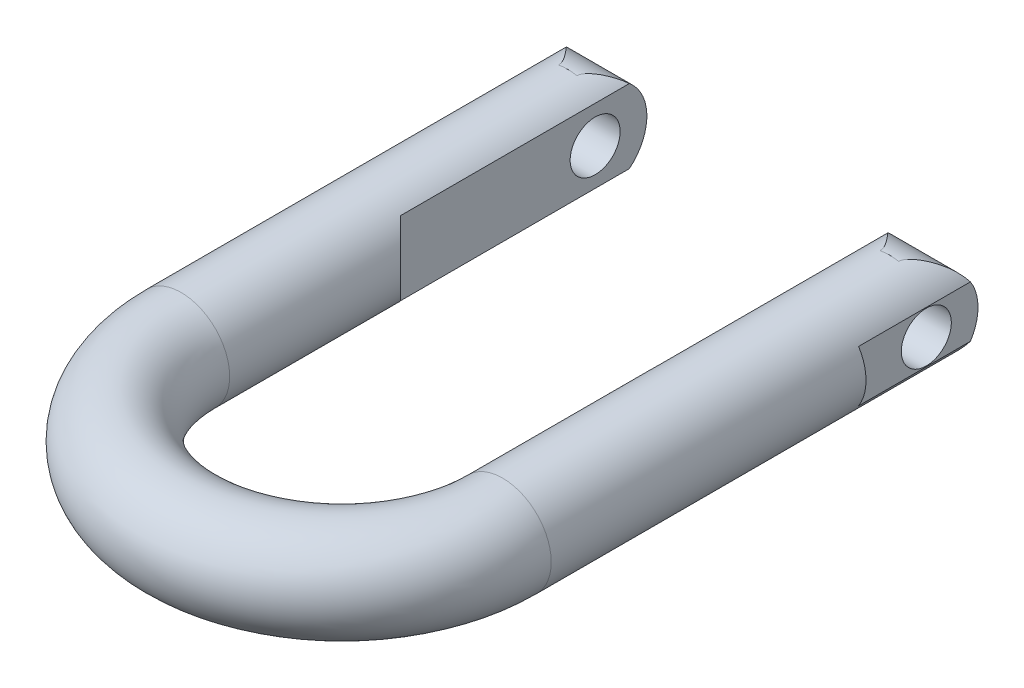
ISO-10303-21;
HEADER;
FILE_DESCRIPTION(('STEP AP214'),'2;1');
FILE_NAME('part.step','',(''),(''),'','','');
FILE_SCHEMA(('AUTOMOTIVE_DESIGN { 1 0 10303 214 1 1 1 1 }'));
ENDSEC;
DATA;
#1=APPLICATION_CONTEXT('core data for automotive mechanical design processes');
#2=APPLICATION_PROTOCOL_DEFINITION('international standard','automotive_design',2000,#1);
#3=PRODUCT_CONTEXT('',#1,'mechanical');
#4=PRODUCT('Part','Part','',(#3));
#5=PRODUCT_RELATED_PRODUCT_CATEGORY('part','',(#4));
#6=PRODUCT_DEFINITION_FORMATION('','',#4);
#7=PRODUCT_DEFINITION_CONTEXT('part definition',#1,'design');
#8=PRODUCT_DEFINITION('design','',#6,#7);
#9=PRODUCT_DEFINITION_SHAPE('','',#8);
#10=(LENGTH_UNIT() NAMED_UNIT(*) SI_UNIT(.MILLI.,.METRE.));
#11=(NAMED_UNIT(*) PLANE_ANGLE_UNIT() SI_UNIT($,.RADIAN.));
#12=(NAMED_UNIT(*) SI_UNIT($,.STERADIAN.) SOLID_ANGLE_UNIT());
#13=UNCERTAINTY_MEASURE_WITH_UNIT(LENGTH_MEASURE(1.E-05),#10,'distance_accuracy_value','');
#14=(GEOMETRIC_REPRESENTATION_CONTEXT(3) GLOBAL_UNCERTAINTY_ASSIGNED_CONTEXT((#13)) GLOBAL_UNIT_ASSIGNED_CONTEXT((#10,
#11,#12)) REPRESENTATION_CONTEXT('',''));
#15=CARTESIAN_POINT('',(0.,0.,0.));
#16=DIRECTION('',(0.,0.,1.));
#17=DIRECTION('',(1.,0.,0.));
#18=AXIS2_PLACEMENT_3D('',#15,#16,#17);
#19=CARTESIAN_POINT('',(-20.19,25.,-5.17000000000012));
#20=DIRECTION('',(1.,0.,0.));
#21=DIRECTION('',(0.,0.,1.));
#22=AXIS2_PLACEMENT_3D('',#19,#20,#21);
#23=PLANE('',#22);
#24=CARTESIAN_POINT('',(-20.19,0.,-0.41));
#25=DIRECTION('',(1.,0.,0.));
#26=DIRECTION('',(0.,0.,1.));
#27=AXIS2_PLACEMENT_3D('',#24,#25,#26);
#28=CIRCLE('',#27,4.76);
#29=CARTESIAN_POINT('',(-20.19,-2.57495631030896,-4.41339855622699));
#30=VERTEX_POINT('',#29);
#31=CARTESIAN_POINT('',(-20.19,2.57495631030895,-4.413398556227));
#32=VERTEX_POINT('',#31);
#33=EDGE_CURVE('E130',#30,#32,#28,.T.);
#34=ORIENTED_EDGE('',*,*,#33,.F.);
#35=DIRECTION('',(0.,0.,-1.));
#36=VECTOR('',#35,1.);
#37=CARTESIAN_POINT('',(-20.19,-2.57495631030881,38.25));
#38=LINE('',#37,#36);
#39=CARTESIAN_POINT('',(-20.19,-2.57495631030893,6.77));
#40=VERTEX_POINT('',#39);
#41=EDGE_CURVE('E135',#40,#30,#38,.T.);
#42=ORIENTED_EDGE('',*,*,#41,.F.);
#43=DIRECTION('',(0.,-1.,0.));
#44=VECTOR('',#43,1.);
#45=CARTESIAN_POINT('',(-20.19,25.,6.77));
#46=LINE('',#45,#44);
#47=CARTESIAN_POINT('',(-20.19,2.57495631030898,6.77));
#48=VERTEX_POINT('',#47);
#49=EDGE_CURVE('E158',#48,#40,#46,.T.);
#50=ORIENTED_EDGE('',*,*,#49,.F.);
#51=DIRECTION('',(0.,0.,-1.));
#52=VECTOR('',#51,1.);
#53=CARTESIAN_POINT('',(-20.19,2.5749563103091,38.25));
#54=LINE('',#53,#52);
#55=EDGE_CURVE('E142',#32,#48,#54,.F.);
#56=ORIENTED_EDGE('',*,*,#55,.F.);
#57=EDGE_LOOP('',(#34,#42,#50,#56));
#58=FACE_BOUND('',#57,.T.);
#59=CARTESIAN_POINT('',(-20.19,0.,0.));
#60=DIRECTION('',(1.,0.,0.));
#61=DIRECTION('',(0.,0.,-1.));
#62=AXIS2_PLACEMENT_3D('',#59,#60,#61);
#63=CIRCLE('',#62,2.5);
#64=CARTESIAN_POINT('',(-20.19,0.,-2.50000000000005));
#65=VERTEX_POINT('',#64);
#66=EDGE_CURVE('E19',#65,#65,#63,.F.);
#67=ORIENTED_EDGE('',*,*,#66,.F.);
#68=EDGE_LOOP('',(#67));
#69=FACE_BOUND('',#68,.T.);
#70=ADVANCED_FACE('F14',(#58,#69),#23,.F.);
#71=CARTESIAN_POINT('',(20.19,25.,-5.17000000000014));
#72=DIRECTION('',(1.,0.,0.));
#73=DIRECTION('',(0.,0.,1.));
#74=AXIS2_PLACEMENT_3D('',#71,#72,#73);
#75=PLANE('',#74);
#76=CARTESIAN_POINT('',(20.19,0.,-0.41));
#77=DIRECTION('',(1.,0.,0.));
#78=DIRECTION('',(0.,0.,1.));
#79=AXIS2_PLACEMENT_3D('',#76,#77,#78);
#80=CIRCLE('',#79,4.76);
#81=CARTESIAN_POINT('',(20.19,-2.57495631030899,-4.413398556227));
#82=VERTEX_POINT('',#81);
#83=CARTESIAN_POINT('',(20.19,2.57495631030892,-4.41339855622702));
#84=VERTEX_POINT('',#83);
#85=EDGE_CURVE('E110',#82,#84,#80,.T.);
#86=ORIENTED_EDGE('',*,*,#85,.T.);
#87=DIRECTION('',(0.,0.,-1.));
#88=VECTOR('',#87,1.);
#89=CARTESIAN_POINT('',(20.19,2.57495631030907,38.25));
#90=LINE('',#89,#88);
#91=CARTESIAN_POINT('',(20.19,2.57495631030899,6.77));
#92=VERTEX_POINT('',#91);
#93=EDGE_CURVE('E94',#92,#84,#90,.T.);
#94=ORIENTED_EDGE('',*,*,#93,.F.);
#95=DIRECTION('',(0.,-1.,0.));
#96=VECTOR('',#95,1.);
#97=CARTESIAN_POINT('',(20.19,25.,6.77));
#98=LINE('',#97,#96);
#99=CARTESIAN_POINT('',(20.19,-2.57495631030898,6.77));
#100=VERTEX_POINT('',#99);
#101=EDGE_CURVE('E121',#92,#100,#98,.T.);
#102=ORIENTED_EDGE('',*,*,#101,.T.);
#103=DIRECTION('',(0.,0.,-1.));
#104=VECTOR('',#103,1.);
#105=CARTESIAN_POINT('',(20.19,-2.57495631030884,38.25));
#106=LINE('',#105,#104);
#107=EDGE_CURVE('E105',#82,#100,#106,.F.);
#108=ORIENTED_EDGE('',*,*,#107,.F.);
#109=EDGE_LOOP('',(#86,#94,#102,#108));
#110=FACE_BOUND('',#109,.T.);
#111=CARTESIAN_POINT('',(20.19,0.,0.));
#112=DIRECTION('',(-1.,0.,0.));
#113=DIRECTION('',(0.,0.,1.));
#114=AXIS2_PLACEMENT_3D('',#111,#112,#113);
#115=CIRCLE('',#114,2.5);
#116=CARTESIAN_POINT('',(20.19,0.,2.49999999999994));
#117=VERTEX_POINT('',#116);
#118=EDGE_CURVE('E247',#117,#117,#115,.F.);
#119=ORIENTED_EDGE('',*,*,#118,.F.);
#120=EDGE_LOOP('',(#119));
#121=FACE_BOUND('',#120,.T.);
#122=ADVANCED_FACE('F119',(#110,#121),#75,.T.);
#123=CARTESIAN_POINT('',(16.08,1.14373434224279E-13,38.25));
#124=DIRECTION('',(0.,0.,-1.));
#125=DIRECTION('',(1.,0.,0.));
#126=AXIS2_PLACEMENT_3D('',#123,#124,#125);
#127=CYLINDRICAL_SURFACE('',#126,4.85);
#128=CARTESIAN_POINT('',(16.08,1.14373434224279E-13,38.25));
#129=DIRECTION('',(0.,0.,-1.));
#130=DIRECTION('',(0.,-1.,0.));
#131=AXIS2_PLACEMENT_3D('',#128,#129,#130);
#132=CIRCLE('',#131,4.85);
#133=CARTESIAN_POINT('',(20.93,1.11485960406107E-13,38.25));
#134=VERTEX_POINT('',#133);
#135=EDGE_CURVE('E123',#134,#134,#132,.T.);
#136=ORIENTED_EDGE('',*,*,#135,.T.);
#137=EDGE_LOOP('',(#136));
#138=FACE_BOUND('',#137,.T.);
#139=CARTESIAN_POINT('',(16.08,0.,-0.41));
#140=DIRECTION('',(0.,0.,1.));
#141=DIRECTION('',(0.,-1.,0.));
#142=AXIS2_PLACEMENT_3D('',#139,#140,#141);
#143=CIRCLE('',#142,4.85);
#144=CARTESIAN_POINT('',(17.01,-4.76,-0.41));
#145=VERTEX_POINT('',#144);
#146=CARTESIAN_POINT('',(15.15,-4.76,-0.41));
#147=VERTEX_POINT('',#146);
#148=EDGE_CURVE('E244',#145,#147,#143,.F.);
#149=ORIENTED_EDGE('',*,*,#148,.F.);
#150=CARTESIAN_POINT('',(20.93,0.,4.35));
#151=CARTESIAN_POINT('',(20.9299989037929,-0.106790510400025,4.3499989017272));
#152=CARTESIAN_POINT('',(20.9264644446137,-0.21362050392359,4.34639775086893));
#153=CARTESIAN_POINT('',(20.9123985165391,-0.426388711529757,4.33206466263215));
#154=CARTESIAN_POINT('',(20.9018620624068,-0.532326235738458,4.32132764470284));
#155=CARTESIAN_POINT('',(20.8739873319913,-0.742601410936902,4.29291634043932));
#156=CARTESIAN_POINT('',(20.856634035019,-0.84693499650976,4.27522673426));
#157=CARTESIAN_POINT('',(20.8154740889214,-1.05301211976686,4.23325658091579));
#158=CARTESIAN_POINT('',(20.7916642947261,-1.1547543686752,4.20897282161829));
#159=CARTESIAN_POINT('',(20.7382552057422,-1.35415161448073,4.15447922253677));
#160=CARTESIAN_POINT('',(20.7087031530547,-1.45183255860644,4.12431773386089));
#161=CARTESIAN_POINT('',(20.6441786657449,-1.64347419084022,4.0584305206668));
#162=CARTESIAN_POINT('',(20.6092041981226,-1.73743346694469,4.02270270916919));
#163=CARTESIAN_POINT('',(20.4969787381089,-2.01297797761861,3.90799165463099));
#164=CARTESIAN_POINT('',(20.41236227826,-2.18845988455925,3.82141617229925));
#165=CARTESIAN_POINT('',(20.1895960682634,-2.58955760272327,3.59309309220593));
#166=CARTESIAN_POINT('',(20.0437149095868,-2.80627000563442,3.44327149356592));
#167=CARTESIAN_POINT('',(19.808797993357,-3.10397490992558,3.20101362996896));
#168=CARTESIAN_POINT('',(19.7276512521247,-3.19879324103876,3.11717546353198));
#169=CARTESIAN_POINT('',(19.5608842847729,-3.37950297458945,2.94442456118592));
#170=CARTESIAN_POINT('',(19.4752641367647,-3.4653945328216,2.85551191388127));
#171=CARTESIAN_POINT('',(19.2676736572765,-3.65899625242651,2.6391984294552));
#172=CARTESIAN_POINT('',(19.1441033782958,-3.76282359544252,2.50985879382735));
#173=CARTESIAN_POINT('',(18.8921431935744,-3.95467122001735,2.24424865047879));
#174=CARTESIAN_POINT('',(18.76375071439,-4.04268291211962,2.10797442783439));
#175=CARTESIAN_POINT('',(18.5043943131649,-4.20333760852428,1.82949818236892));
#176=CARTESIAN_POINT('',(18.3734348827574,-4.27600522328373,1.68730609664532));
#177=CARTESIAN_POINT('',(18.1111222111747,-4.40663297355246,1.39681914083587));
#178=CARTESIAN_POINT('',(17.9797692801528,-4.46460260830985,1.24852828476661));
#179=CARTESIAN_POINT('',(17.7659191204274,-4.54845218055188,0.997153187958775));
#180=CARTESIAN_POINT('',(17.6823566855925,-4.57847329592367,0.896335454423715));
#181=CARTESIAN_POINT('',(17.5189246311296,-4.63242285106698,0.689863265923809));
#182=CARTESIAN_POINT('',(17.439058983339,-4.65634485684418,0.584203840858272));
#183=CARTESIAN_POINT('',(17.3074653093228,-4.6924666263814,0.393273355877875));
#184=CARTESIAN_POINT('',(17.2537493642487,-4.70610025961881,0.309657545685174));
#185=CARTESIAN_POINT('',(17.1561574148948,-4.7293605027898,0.136233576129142));
#186=CARTESIAN_POINT('',(17.1122489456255,-4.73900042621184,0.0464471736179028));
#187=CARTESIAN_POINT('',(17.0587613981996,-4.75025768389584,-0.100924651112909));
#188=CARTESIAN_POINT('',(17.0425309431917,-4.75354292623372,-0.155868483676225));
#189=CARTESIAN_POINT('',(17.0192542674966,-4.75819787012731,-0.267663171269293));
#190=CARTESIAN_POINT('',(17.0121755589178,-4.75957434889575,-0.324506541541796));
#191=CARTESIAN_POINT('',(17.0086856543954,-4.76025735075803,-0.43888551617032));
#192=CARTESIAN_POINT('',(17.0123362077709,-4.75955189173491,-0.496423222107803));
#193=CARTESIAN_POINT('',(17.0295848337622,-4.75613900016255,-0.609980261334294));
#194=CARTESIAN_POINT('',(17.0432103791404,-4.7534260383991,-0.665994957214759));
#195=CARTESIAN_POINT('',(17.0882592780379,-4.74412078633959,-0.808303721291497));
#196=CARTESIAN_POINT('',(17.1254562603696,-4.73617750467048,-0.892596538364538));
#197=CARTESIAN_POINT('',(17.2099670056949,-4.71673388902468,-1.05561738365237));
#198=CARTESIAN_POINT('',(17.2573344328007,-4.70521453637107,-1.13431282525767));
#199=CARTESIAN_POINT('',(17.353736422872,-4.68000063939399,-1.28198682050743));
#200=CARTESIAN_POINT('',(17.4023928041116,-4.66652809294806,-1.3512544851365));
#201=CARTESIAN_POINT('',(17.5024182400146,-4.63702028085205,-1.48725676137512));
#202=CARTESIAN_POINT('',(17.5537887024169,-4.62098367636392,-1.55399002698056));
#203=CARTESIAN_POINT('',(17.710397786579,-4.56906602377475,-1.75158705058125));
#204=CARTESIAN_POINT('',(17.8179705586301,-4.52941809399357,-1.87961607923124));
#205=CARTESIAN_POINT('',(18.0350334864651,-4.44007026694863,-2.13078802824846));
#206=CARTESIAN_POINT('',(18.1445267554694,-4.39035233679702,-2.25392170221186));
#207=CARTESIAN_POINT('',(18.3630969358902,-4.28075879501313,-2.49573881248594));
#208=CARTESIAN_POINT('',(18.4721741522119,-4.22089328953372,-2.61442653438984));
#209=CARTESIAN_POINT('',(18.6882431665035,-4.09089513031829,-2.8471867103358));
#210=CARTESIAN_POINT('',(18.7952406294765,-4.0207967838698,-2.96127302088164));
#211=CARTESIAN_POINT('',(19.0064097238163,-3.86981671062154,-3.18494690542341));
#212=CARTESIAN_POINT('',(19.1105804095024,-3.78893142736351,-3.29453298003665));
#213=CARTESIAN_POINT('',(19.3147382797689,-3.61618719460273,-3.50832739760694));
#214=CARTESIAN_POINT('',(19.4147335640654,-3.5243509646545,-3.61254625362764));
#215=CARTESIAN_POINT('',(19.6095129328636,-3.32926997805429,-3.81489500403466));
#216=CARTESIAN_POINT('',(19.7042988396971,-3.2260292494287,-3.91302702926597));
#217=CARTESIAN_POINT('',(19.9340813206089,-2.95208485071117,-4.15036440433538));
#218=CARTESIAN_POINT('',(20.0649580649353,-2.77381021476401,-4.28502075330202));
#219=CARTESIAN_POINT('',(20.3061438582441,-2.39027783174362,-4.53264108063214));
#220=CARTESIAN_POINT('',(20.4164738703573,-2.18504795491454,-4.64562717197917));
#221=CARTESIAN_POINT('',(20.592811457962,-1.78760224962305,-4.82597757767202));
#222=CARTESIAN_POINT('',(20.6632013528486,-1.59944403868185,-4.89787056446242));
#223=CARTESIAN_POINT('',(20.7517455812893,-1.30679974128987,-4.98824663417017));
#224=CARTESIAN_POINT('',(20.7784243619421,-1.20749330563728,-5.01546563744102));
#225=CARTESIAN_POINT('',(20.8256534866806,-1.00596408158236,-5.06363833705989));
#226=CARTESIAN_POINT('',(20.8462064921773,-0.903742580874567,-5.0845947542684));
#227=CARTESIAN_POINT('',(20.8809030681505,-0.696387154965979,-5.11996625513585));
#228=CARTESIAN_POINT('',(20.8950035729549,-0.591238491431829,-5.13433738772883));
#229=CARTESIAN_POINT('',(20.9162938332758,-0.37956446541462,-5.15603439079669));
#230=CARTESIAN_POINT('',(20.9234866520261,-0.273039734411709,-5.16336338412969));
#231=CARTESIAN_POINT('',(20.9308116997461,-0.0594951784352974,-5.17082709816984));
#232=CARTESIAN_POINT('',(20.9309439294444,0.0475246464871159,-5.17096181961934));
#233=CARTESIAN_POINT('',(20.9241451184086,0.261098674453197,-5.16403432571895));
#234=CARTESIAN_POINT('',(20.9172145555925,0.367652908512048,-5.1569725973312));
#235=CARTESIAN_POINT('',(20.8974693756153,0.568930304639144,-5.13685038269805));
#236=CARTESIAN_POINT('',(20.8853022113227,0.663784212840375,-5.1244499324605));
#237=CARTESIAN_POINT('',(20.8555707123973,0.851759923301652,-5.09414176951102));
#238=CARTESIAN_POINT('',(20.8380046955,0.944881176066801,-5.07623234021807));
#239=CARTESIAN_POINT('',(20.7776199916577,1.22074242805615,-5.01464980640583));
#240=CARTESIAN_POINT('',(20.7270988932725,1.40013424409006,-4.96310641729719));
#241=CARTESIAN_POINT('',(20.6048877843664,1.75657087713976,-4.83830439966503));
#242=CARTESIAN_POINT('',(20.5321205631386,1.93284638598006,-4.76393977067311));
#243=CARTESIAN_POINT('',(20.3704364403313,2.26925988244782,-4.59846638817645));
#244=CARTESIAN_POINT('',(20.2815127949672,2.42939108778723,-4.50735064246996));
#245=CARTESIAN_POINT('',(20.0372624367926,2.81793701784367,-4.25658975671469));
#246=CARTESIAN_POINT('',(19.8726564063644,3.0343066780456,-4.08716219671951));
#247=CARTESIAN_POINT('',(19.6101586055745,3.32834627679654,-3.81553312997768));
#248=CARTESIAN_POINT('',(19.5198568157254,3.42143545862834,-3.72186208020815));
#249=CARTESIAN_POINT('',(19.3350315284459,3.59771477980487,-3.52946203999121));
#250=CARTESIAN_POINT('',(19.2405085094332,3.68090603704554,-3.43073362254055));
#251=CARTESIAN_POINT('',(19.0146576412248,3.8650085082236,-3.19371107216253));
#252=CARTESIAN_POINT('',(18.881993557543,3.9619772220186,-3.05362935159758));
#253=CARTESIAN_POINT('',(18.6128937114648,4.13919416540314,-2.76651286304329));
#254=CARTESIAN_POINT('',(18.4764550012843,4.21942888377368,-2.61947259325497));
#255=CARTESIAN_POINT('',(18.2026304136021,4.36356986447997,-2.31908690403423));
#256=CARTESIAN_POINT('',(18.0652473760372,4.42751264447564,-2.16575649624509));
#257=CARTESIAN_POINT('',(17.861391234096,4.51160360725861,-1.92985690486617));
#258=CARTESIAN_POINT('',(17.7938397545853,4.53765404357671,-1.8502780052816));
#259=CARTESIAN_POINT('',(17.660384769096,4.5858367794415,-1.68860323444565));
#260=CARTESIAN_POINT('',(17.594480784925,4.60797022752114,-1.60650810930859));
#261=CARTESIAN_POINT('',(17.4672322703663,4.64784218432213,-1.44067387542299));
#262=CARTESIAN_POINT('',(17.4058207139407,4.66566388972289,-1.3570064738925));
#263=CARTESIAN_POINT('',(17.2888094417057,4.69732975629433,-1.18483845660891));
#264=CARTESIAN_POINT('',(17.2332071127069,4.71117571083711,-1.09634004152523));
#265=CARTESIAN_POINT('',(17.1511439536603,4.73035755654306,-0.943859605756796));
#266=CARTESIAN_POINT('',(17.1212438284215,4.73698180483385,-0.88193888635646));
#267=CARTESIAN_POINT('',(17.0700339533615,4.74794890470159,-0.754449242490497));
#268=CARTESIAN_POINT('',(17.0486982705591,4.75229865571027,-0.688892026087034));
#269=CARTESIAN_POINT('',(17.0221466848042,4.75762654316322,-0.569216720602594));
#270=CARTESIAN_POINT('',(17.0144388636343,4.7591311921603,-0.515699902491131));
#271=CARTESIAN_POINT('',(17.0084582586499,4.76030231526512,-0.408154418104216));
#272=CARTESIAN_POINT('',(17.0101730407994,4.75997121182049,-0.354126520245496));
#273=CARTESIAN_POINT('',(17.0226055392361,4.75752323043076,-0.247471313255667));
#274=CARTESIAN_POINT('',(17.0332828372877,4.75541436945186,-0.194838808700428));
#275=CARTESIAN_POINT('',(17.0617359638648,4.74962125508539,-0.0915903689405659));
#276=CARTESIAN_POINT('',(17.0795276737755,4.74593347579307,-0.0409792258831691));
#277=CARTESIAN_POINT('',(17.1284502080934,4.7354088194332,0.0782825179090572));
#278=CARTESIAN_POINT('',(17.1620596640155,4.72790076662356,0.14582874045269));
#279=CARTESIAN_POINT('',(17.235173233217,4.71057310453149,0.277397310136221));
#280=CARTESIAN_POINT('',(17.2746913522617,4.70074797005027,0.341410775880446));
#281=CARTESIAN_POINT('',(17.3575749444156,4.67890551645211,0.467239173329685));
#282=CARTESIAN_POINT('',(17.4009691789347,4.66687096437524,0.529031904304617));
#283=CARTESIAN_POINT('',(17.4899064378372,4.64077741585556,0.650488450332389));
#284=CARTESIAN_POINT('',(17.5354472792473,4.62672044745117,0.710154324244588));
#285=CARTESIAN_POINT('',(17.6470495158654,4.59037856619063,0.852307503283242));
#286=CARTESIAN_POINT('',(17.7137930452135,4.56709815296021,0.934004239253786));
#287=CARTESIAN_POINT('',(17.8486442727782,4.51659164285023,1.09502712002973));
#288=CARTESIAN_POINT('',(17.9167523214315,4.48936452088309,1.17435264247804));
#289=CARTESIAN_POINT('',(18.12202665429,4.40167460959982,1.40960087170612));
#290=CARTESIAN_POINT('',(18.2600119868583,4.3352447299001,1.56263502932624));
#291=CARTESIAN_POINT('',(18.5338179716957,4.18635251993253,1.86151166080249));
#292=CARTESIAN_POINT('',(18.6696447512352,4.10395051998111,2.0073786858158));
#293=CARTESIAN_POINT('',(18.9372242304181,3.92235736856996,2.29207262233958));
#294=CARTESIAN_POINT('',(19.0689801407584,3.82317986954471,2.43090514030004));
#295=CARTESIAN_POINT('',(19.2886784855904,3.63881970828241,2.66107630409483));
#296=CARTESIAN_POINT('',(19.3781754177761,3.55801345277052,2.75444067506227));
#297=CARTESIAN_POINT('',(19.5532068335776,3.38737223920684,2.93647459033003));
#298=CARTESIAN_POINT('',(19.638741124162,3.29753684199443,3.02514390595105));
#299=CARTESIAN_POINT('',(19.8878701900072,3.01425380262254,3.28281901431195));
#300=CARTESIAN_POINT('',(20.0443631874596,2.80672540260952,3.44387998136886));
#301=CARTESIAN_POINT('',(20.2960874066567,2.40614124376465,3.70231360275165));
#302=CARTESIAN_POINT('',(20.3971355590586,2.22069551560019,3.80581948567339));
#303=CARTESIAN_POINT('',(20.5771754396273,1.82873923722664,3.99000771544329));
#304=CARTESIAN_POINT('',(20.6561835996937,1.62224453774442,4.07070706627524));
#305=CARTESIAN_POINT('',(20.7769004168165,1.22399181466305,4.19392234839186));
#306=CARTESIAN_POINT('',(20.8224135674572,1.03462557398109,4.24033695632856));
#307=CARTESIAN_POINT('',(20.8734816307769,0.744774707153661,4.29240116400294));
#308=CARTESIAN_POINT('',(20.8876329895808,0.647269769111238,4.30682515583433));
#309=CARTESIAN_POINT('',(20.9100027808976,0.450899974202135,4.32962360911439));
#310=CARTESIAN_POINT('',(20.9182247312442,0.352035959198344,4.33800165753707));
#311=CARTESIAN_POINT('',(20.9255999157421,0.21080983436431,4.34551665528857));
#312=CARTESIAN_POINT('',(20.9272490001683,0.168686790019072,4.34719695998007));
#313=CARTESIAN_POINT('',(20.9294493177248,0.0843778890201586,4.34943890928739));
#314=CARTESIAN_POINT('',(20.9300004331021,0.0421920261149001,4.35000043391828));
#315=CARTESIAN_POINT('',(20.93,0.,4.35));
#316=B_SPLINE_CURVE_WITH_KNOTS('',3,(#150,#151,#152,#153,#154,#155,#156,#157,#158,#159,#160,
#161,#162,#163,#164,#165,#166,#167,#168,#169,#170,#171,#172,#173,#174,#175,#176,#177,#178,#179,
#180,#181,#182,#183,#184,#185,#186,#187,#188,#189,#190,#191,#192,#193,#194,#195,#196,#197,#198,
#199,#200,#201,#202,#203,#204,#205,#206,#207,#208,#209,#210,#211,#212,#213,#214,#215,#216,#217,
#218,#219,#220,#221,#222,#223,#224,#225,#226,#227,#228,#229,#230,#231,#232,#233,#234,#235,#236,
#237,#238,#239,#240,#241,#242,#243,#244,#245,#246,#247,#248,#249,#250,#251,#252,#253,#254,#255,
#256,#257,#258,#259,#260,#261,#262,#263,#264,#265,#266,#267,#268,#269,#270,#271,#272,#273,#274,
#275,#276,#277,#278,#279,#280,#281,#282,#283,#284,#285,#286,#287,#288,#289,#290,#291,#292,#293,
#294,#295,#296,#297,#298,#299,#300,#301,#302,#303,#304,#305,#306,#307,#308,#309,#310,#311,#312,
#313,#314,#315),.UNSPECIFIED.,.T.,.F.,(4,2,2,2,2,2,2,2,2,2,2,2,2,2,2,2,2,2,2,2,2,2,2,2,2,2,2,2,
2,2,2,2,2,2,2,2,2,2,2,2,2,2,2,2,2,2,2,2,2,2,2,2,2,2,2,2,2,2,2,2,2,2,2,2,2,2,2,2,2,2,2,2,2,2,2,2,
2,2,2,2,2,2,4),(0.,0.320322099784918,0.640872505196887,0.962133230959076,1.28355073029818,
1.6024280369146,1.9214251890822,2.55868639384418,3.45695125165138,3.90768818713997,
4.35841725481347,4.97802461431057,5.5979674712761,6.21690831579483,6.83544811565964,
7.23831245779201,7.64160004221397,7.94224488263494,8.24187926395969,8.41343015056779,
8.58437035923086,8.75629629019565,8.92869752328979,9.20455622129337,9.48190791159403,
9.73888207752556,9.99599086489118,10.5110658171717,11.0270714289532,11.5425661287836,
12.0563706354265,12.5703449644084,13.0832709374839,13.5960163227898,14.3700206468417,
15.143230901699,15.7804751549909,16.0992427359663,16.4178716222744,16.7385971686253,
17.0591804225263,17.3797636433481,17.7003251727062,17.9892834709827,18.2783318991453,
18.8559663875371,19.4678375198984,20.0799646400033,21.0352501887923,21.5148946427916,
21.9944848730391,22.6413805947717,23.2887966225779,23.9347484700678,24.2574250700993,
24.5800068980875,24.8957526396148,25.2113557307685,25.4181973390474,25.6244078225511,
25.7859126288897,25.9472043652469,26.1077726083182,26.2687013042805,26.4955615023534,
26.722968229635,26.9522304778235,27.1812644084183,27.5052229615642,27.8292658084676,
28.4779830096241,29.1242959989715,29.7700855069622,30.2272070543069,30.68435084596,
31.5968030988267,32.2998370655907,33.0023454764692,33.6001327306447,33.8985574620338,
34.1968049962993,34.3233479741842,34.4499045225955),.UNSPECIFIED.);
#317=EDGE_CURVE('E117',#145,#82,#316,.T.);
#318=ORIENTED_EDGE('',*,*,#317,.T.);
#319=ORIENTED_EDGE('',*,*,#107,.T.);
#320=CARTESIAN_POINT('',(16.08,0.,6.77));
#321=DIRECTION('',(0.,0.,1.));
#322=DIRECTION('',(0.,-1.,0.));
#323=AXIS2_PLACEMENT_3D('',#320,#321,#322);
#324=CIRCLE('',#323,4.85);
#325=EDGE_CURVE('E100',#92,#100,#324,.F.);
#326=ORIENTED_EDGE('',*,*,#325,.F.);
#327=ORIENTED_EDGE('',*,*,#93,.T.);
#328=CARTESIAN_POINT('',(17.01,4.76,-0.41));
#329=VERTEX_POINT('',#328);
#330=EDGE_CURVE('E98',#84,#329,#316,.T.);
#331=ORIENTED_EDGE('',*,*,#330,.T.);
#332=CARTESIAN_POINT('',(16.08,0.,-0.41));
#333=DIRECTION('',(0.,0.,-1.));
#334=DIRECTION('',(0.,1.,0.));
#335=AXIS2_PLACEMENT_3D('',#332,#333,#334);
#336=CIRCLE('',#335,4.85);
#337=CARTESIAN_POINT('',(15.15,4.76,-0.41));
#338=VERTEX_POINT('',#337);
#339=EDGE_CURVE('E115',#329,#338,#336,.F.);
#340=ORIENTED_EDGE('',*,*,#339,.T.);
#341=CARTESIAN_POINT('',(15.15,4.76,-0.41));
#342=CARTESIAN_POINT('',(15.1499876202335,4.75999853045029,-0.477529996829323));
#343=CARTESIAN_POINT('',(15.1424226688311,4.75853750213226,-0.545072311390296));
#344=CARTESIAN_POINT('',(15.1144993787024,4.75294471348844,-0.677552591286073));
#345=CARTESIAN_POINT('',(15.0940580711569,4.74879562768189,-0.742470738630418));
#346=CARTESIAN_POINT('',(15.0434295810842,4.73800810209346,-0.871863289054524));
#347=CARTESIAN_POINT('',(15.0127950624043,4.73125256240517,-0.936142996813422));
#348=CARTESIAN_POINT('',(14.945781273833,4.71563760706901,-1.06142489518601));
#349=CARTESIAN_POINT('',(14.9093904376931,4.70677393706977,-1.12242014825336));
#350=CARTESIAN_POINT('',(14.8328821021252,4.68708544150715,-1.24218532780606));
#351=CARTESIAN_POINT('',(14.7927433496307,4.67624905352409,-1.30093952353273));
#352=CARTESIAN_POINT('',(14.7102247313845,4.65274775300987,-1.41648467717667));
#353=CARTESIAN_POINT('',(14.6678440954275,4.64008220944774,-1.47327494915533));
#354=CARTESIAN_POINT('',(14.5606839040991,4.60637381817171,-1.61261227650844));
#355=CARTESIAN_POINT('',(14.4950454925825,4.58425468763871,-1.69423705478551));
#356=CARTESIAN_POINT('',(14.3621886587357,4.53614759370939,-1.85498668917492));
#357=CARTESIAN_POINT('',(14.2949702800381,4.51015973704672,-1.9341116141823));
#358=CARTESIAN_POINT('',(14.0921030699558,4.42630169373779,-2.16872792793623));
#359=CARTESIAN_POINT('',(13.9554003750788,4.36258522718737,-2.32126461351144));
#360=CARTESIAN_POINT('',(13.6836684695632,4.21944141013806,-2.6193202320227));
#361=CARTESIAN_POINT('',(13.548635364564,4.14006377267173,-2.76485960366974));
#362=CARTESIAN_POINT('',(13.2822555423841,3.96490978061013,-3.04911714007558));
#363=CARTESIAN_POINT('',(13.1509058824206,3.86914697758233,-3.18784082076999));
#364=CARTESIAN_POINT('',(12.9289597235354,3.6888949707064,-3.42081818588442));
#365=CARTESIAN_POINT('',(12.8370042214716,3.60843500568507,-3.51689621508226));
#366=CARTESIAN_POINT('',(12.6570273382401,3.43818579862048,-3.70431736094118));
#367=CARTESIAN_POINT('',(12.5690062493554,3.34839586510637,-3.79566012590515));
#368=CARTESIAN_POINT('',(12.312437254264,3.06477096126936,-4.06126553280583));
#369=CARTESIAN_POINT('',(12.1509877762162,2.85636819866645,-4.2275187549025));
#370=CARTESIAN_POINT('',(11.8920114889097,2.4547929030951,-4.49350528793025));
#371=CARTESIAN_POINT('',(11.7884128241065,2.2697781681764,-4.59965641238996));
#372=CARTESIAN_POINT('',(11.6032163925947,1.87819413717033,-4.78916650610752));
#373=CARTESIAN_POINT('',(11.5215914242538,1.67165193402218,-4.87255365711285));
#374=CARTESIAN_POINT('',(11.3962653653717,1.27350771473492,-5.0004909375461));
#375=CARTESIAN_POINT('',(11.3486825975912,1.08441812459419,-5.04902091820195));
#376=CARTESIAN_POINT('',(11.2763898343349,0.697478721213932,-5.12272991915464));
#377=CARTESIAN_POINT('',(11.2516667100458,0.49963400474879,-5.14792234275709));
#378=CARTESIAN_POINT('',(11.2268994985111,0.100232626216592,-5.17315971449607));
#379=CARTESIAN_POINT('',(11.2269227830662,-0.101332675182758,-5.17313601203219));
#380=CARTESIAN_POINT('',(11.2518150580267,-0.501297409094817,-5.14777115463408));
#381=CARTESIAN_POINT('',(11.2766879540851,-0.699696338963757,-5.12242601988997));
#382=CARTESIAN_POINT('',(11.3479596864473,-1.07994170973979,-5.04975793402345));
#383=CARTESIAN_POINT('',(11.3934742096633,-1.26213223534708,-5.00333778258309));
#384=CARTESIAN_POINT('',(11.5029484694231,-1.61469505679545,-4.89158727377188));
#385=CARTESIAN_POINT('',(11.5669153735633,-1.78506272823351,-4.82624956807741));
#386=CARTESIAN_POINT('',(11.7391063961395,-2.17753465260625,-4.65015702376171));
#387=CARTESIAN_POINT('',(11.854786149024,-2.39292326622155,-4.53170180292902));
#388=CARTESIAN_POINT('',(12.1085857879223,-2.7941076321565,-4.27109917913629));
#389=CARTESIAN_POINT('',(12.2467533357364,-2.9798388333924,-4.12890143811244));
#390=CARTESIAN_POINT('',(12.5936893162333,-3.38577699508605,-3.77040615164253));
#391=CARTESIAN_POINT('',(12.8095699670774,-3.59300666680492,-3.54625202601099));
#392=CARTESIAN_POINT('',(13.1460193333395,-3.86459868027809,-3.19291111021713));
#393=CARTESIAN_POINT('',(13.2604022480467,-3.94865570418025,-3.07214160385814));
#394=CARTESIAN_POINT('',(13.4920879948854,-4.10422193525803,-2.82541309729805));
#395=CARTESIAN_POINT('',(13.609389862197,-4.17573522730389,-2.6994558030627));
#396=CARTESIAN_POINT('',(13.811755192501,-4.28799423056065,-2.47914071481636));
#397=CARTESIAN_POINT('',(13.8965038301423,-4.33170725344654,-2.38597883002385));
#398=CARTESIAN_POINT('',(14.0659666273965,-4.41304807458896,-2.19695277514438));
#399=CARTESIAN_POINT('',(14.1506807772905,-4.45067470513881,-2.10108809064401));
#400=CARTESIAN_POINT('',(14.318813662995,-4.51984193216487,-1.90642367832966));
#401=CARTESIAN_POINT('',(14.4022345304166,-4.55139381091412,-1.80762979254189));
#402=CARTESIAN_POINT('',(14.5661388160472,-4.60849261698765,-1.60599326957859));
#403=CARTESIAN_POINT('',(14.646624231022,-4.63404369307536,-1.50315348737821));
#404=CARTESIAN_POINT('',(14.7793871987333,-4.67271690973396,-1.32072357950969));
#405=CARTESIAN_POINT('',(14.8332797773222,-4.6873189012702,-1.24263129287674));
#406=CARTESIAN_POINT('',(14.9345660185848,-4.71308525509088,-1.0816298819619));
#407=CARTESIAN_POINT('',(14.9819629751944,-4.72425136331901,-0.998723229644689));
#408=CARTESIAN_POINT('',(15.0498953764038,-4.73942663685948,-0.855730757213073));
#409=CARTESIAN_POINT('',(15.0740718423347,-4.74457728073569,-0.797548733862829));
#410=CARTESIAN_POINT('',(15.1137241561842,-4.75281243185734,-0.678186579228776));
#411=CARTESIAN_POINT('',(15.1292287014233,-4.75590376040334,-0.617017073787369));
#412=CARTESIAN_POINT('',(15.1469560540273,-4.75941229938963,-0.501721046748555));
#413=CARTESIAN_POINT('',(15.1507816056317,-4.76015284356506,-0.447862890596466));
#414=CARTESIAN_POINT('',(15.1489467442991,-4.75979407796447,-0.340347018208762));
#415=CARTESIAN_POINT('',(15.1432899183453,-4.75869546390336,-0.28668923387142));
#416=CARTESIAN_POINT('',(15.1204194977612,-4.75414257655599,-0.163692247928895));
#417=CARTESIAN_POINT('',(15.1000182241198,-4.75003266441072,-0.0949963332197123));
#418=CARTESIAN_POINT('',(15.0493406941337,-4.73929409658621,0.0385918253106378));
#419=CARTESIAN_POINT('',(15.019009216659,-4.73265132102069,0.103460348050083));
#420=CARTESIAN_POINT('',(14.9334157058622,-4.71282207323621,0.265986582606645));
#421=CARTESIAN_POINT('',(14.8738335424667,-4.69806777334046,0.361107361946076));
#422=CARTESIAN_POINT('',(14.7479500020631,-4.66395431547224,0.546012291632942));
#423=CARTESIAN_POINT('',(14.6816311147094,-4.64458297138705,0.635781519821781));
#424=CARTESIAN_POINT('',(14.5452852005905,-4.60133614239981,0.812120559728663));
#425=CARTESIAN_POINT('',(14.4752401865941,-4.57743704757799,0.898670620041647));
#426=CARTESIAN_POINT('',(14.3335890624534,-4.52529081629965,1.068935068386));
#427=CARTESIAN_POINT('',(14.261984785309,-4.49704857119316,1.15265251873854));
#428=CARTESIAN_POINT('',(14.0517172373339,-4.40807050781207,1.39423263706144));
#429=CARTESIAN_POINT('',(13.9121739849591,-4.34140764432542,1.54919309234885));
#430=CARTESIAN_POINT('',(13.6345805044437,-4.19135076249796,1.85246936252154));
#431=CARTESIAN_POINT('',(13.4965317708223,-4.10794138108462,2.00077892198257));
#432=CARTESIAN_POINT('',(13.2250435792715,-3.92409060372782,2.2896870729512));
#433=CARTESIAN_POINT('',(13.091588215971,-3.82371704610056,2.43031353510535));
#434=CARTESIAN_POINT('',(12.831154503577,-3.60505281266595,2.70315422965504));
#435=CARTESIAN_POINT('',(12.7041709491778,-3.48677684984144,2.83537524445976));
#436=CARTESIAN_POINT('',(12.4284008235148,-3.19956748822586,3.12143969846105));
#437=CARTESIAN_POINT('',(12.2820733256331,-3.0253565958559,3.27245336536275));
#438=CARTESIAN_POINT('',(12.0092478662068,-2.64684703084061,3.55323209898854));
#439=CARTESIAN_POINT('',(11.8827267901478,-2.44258397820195,3.68302194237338));
#440=CARTESIAN_POINT('',(11.6780154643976,-2.04572812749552,3.89267081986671));
#441=CARTESIAN_POINT('',(11.595211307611,-1.85811991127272,3.97732879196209));
#442=CARTESIAN_POINT('',(11.4879565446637,-1.56414781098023,4.08688977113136));
#443=CARTESIAN_POINT('',(11.455023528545,-1.46403476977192,4.12051256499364));
#444=CARTESIAN_POINT('',(11.3953580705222,-1.26011743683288,4.18140580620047));
#445=CARTESIAN_POINT('',(11.3686228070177,-1.1563148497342,4.20867914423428));
#446=CARTESIAN_POINT('',(11.3216671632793,-0.944778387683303,4.2565676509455));
#447=CARTESIAN_POINT('',(11.3015030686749,-0.837018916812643,4.27712529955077));
#448=CARTESIAN_POINT('',(11.2684419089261,-0.619293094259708,4.31082640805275));
#449=CARTESIAN_POINT('',(11.2555412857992,-0.509327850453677,4.3239734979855));
#450=CARTESIAN_POINT('',(11.2372964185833,-0.288151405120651,4.34256574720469));
#451=CARTESIAN_POINT('',(11.2319501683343,-0.17694054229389,4.34801295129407));
#452=CARTESIAN_POINT('',(11.2289379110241,0.0456852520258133,4.3510821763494));
#453=CARTESIAN_POINT('',(11.2312710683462,0.157100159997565,4.34870504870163));
#454=CARTESIAN_POINT('',(11.2427853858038,0.365099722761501,4.3369723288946));
#455=CARTESIAN_POINT('',(11.2510686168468,0.461787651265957,4.32853176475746));
#456=CARTESIAN_POINT('',(11.2733003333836,0.653835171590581,4.30587386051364));
#457=CARTESIAN_POINT('',(11.287250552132,0.749194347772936,4.29165475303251));
#458=CARTESIAN_POINT('',(11.3372633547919,1.03225679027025,4.24066622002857));
#459=CARTESIAN_POINT('',(11.3814984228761,1.21712112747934,4.19555506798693));
#460=CARTESIAN_POINT('',(11.4904507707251,1.57968813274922,4.08435085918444));
#461=CARTESIAN_POINT('',(11.5556835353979,1.75706766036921,4.01772959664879));
#462=CARTESIAN_POINT('',(11.7027972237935,2.09688553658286,3.86729451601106));
#463=CARTESIAN_POINT('',(11.7846849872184,2.25931770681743,3.78347363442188));
#464=CARTESIAN_POINT('',(12.0084124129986,2.64920754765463,3.55407403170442));
#465=CARTESIAN_POINT('',(12.1591799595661,2.86612845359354,3.39915192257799));
#466=CARTESIAN_POINT('',(12.4013128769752,3.1632613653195,3.14924976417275));
#467=CARTESIAN_POINT('',(12.4848572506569,3.2577463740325,3.06285268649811));
#468=CARTESIAN_POINT('',(12.656367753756,3.43753536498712,2.88498318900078));
#469=CARTESIAN_POINT('',(12.7443336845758,3.52283975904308,2.7935109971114));
#470=CARTESIAN_POINT('',(12.9569397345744,3.71434558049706,2.571604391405));
#471=CARTESIAN_POINT('',(13.0831212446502,3.81662226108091,2.43926186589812));
#472=CARTESIAN_POINT('',(13.3400727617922,4.0050819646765,2.16764729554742));
#473=CARTESIAN_POINT('',(13.4708453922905,4.09125560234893,2.02837126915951));
#474=CARTESIAN_POINT('',(13.7346493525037,4.24798163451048,1.74374396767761));
#475=CARTESIAN_POINT('',(13.8676776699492,4.31855332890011,1.59840046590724));
#476=CARTESIAN_POINT('',(14.1335076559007,4.444680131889,1.30129564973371));
#477=CARTESIAN_POINT('',(14.2663094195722,4.50024646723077,1.14953923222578));
#478=CARTESIAN_POINT('',(14.4773599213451,4.57837626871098,0.896273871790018));
#479=CARTESIAN_POINT('',(14.5572286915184,4.60547020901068,0.797491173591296));
#480=CARTESIAN_POINT('',(14.7123634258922,4.65387870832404,0.594941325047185));
#481=CARTESIAN_POINT('',(14.7876321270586,4.67519673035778,0.491177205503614));
#482=CARTESIAN_POINT('',(14.9019491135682,4.70497898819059,0.314960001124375));
#483=CARTESIAN_POINT('',(14.9441829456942,4.71529371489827,0.244919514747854));
#484=CARTESIAN_POINT('',(15.0210012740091,4.73313386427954,0.100248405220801));
#485=CARTESIAN_POINT('',(15.055591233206,4.74066128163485,0.025621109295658));
#486=CARTESIAN_POINT('',(15.1040174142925,4.75083363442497,-0.109189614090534));
#487=CARTESIAN_POINT('',(15.1209009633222,4.75423559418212,-0.168170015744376));
#488=CARTESIAN_POINT('',(15.1438693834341,4.75881357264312,-0.288105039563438));
#489=CARTESIAN_POINT('',(15.150011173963,4.76000132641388,-0.349047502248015));
#490=CARTESIAN_POINT('',(15.15,4.76,-0.41));
#491=B_SPLINE_CURVE_WITH_KNOTS('',3,(#341,#342,#343,#344,#345,#346,#347,#348,#349,#350,#351,
#352,#353,#354,#355,#356,#357,#358,#359,#360,#361,#362,#363,#364,#365,#366,#367,#368,#369,#370,
#371,#372,#373,#374,#375,#376,#377,#378,#379,#380,#381,#382,#383,#384,#385,#386,#387,#388,#389,
#390,#391,#392,#393,#394,#395,#396,#397,#398,#399,#400,#401,#402,#403,#404,#405,#406,#407,#408,
#409,#410,#411,#412,#413,#414,#415,#416,#417,#418,#419,#420,#421,#422,#423,#424,#425,#426,#427,
#428,#429,#430,#431,#432,#433,#434,#435,#436,#437,#438,#439,#440,#441,#442,#443,#444,#445,#446,
#447,#448,#449,#450,#451,#452,#453,#454,#455,#456,#457,#458,#459,#460,#461,#462,#463,#464,#465,
#466,#467,#468,#469,#470,#471,#472,#473,#474,#475,#476,#477,#478,#479,#480,#481,#482,#483,#484,
#485,#486,#487,#488,#489,#490),.UNSPECIFIED.,.T.,.F.,(4,2,2,2,2,2,2,2,2,2,2,2,2,2,2,2,2,2,2,2,2,
2,2,2,2,2,2,2,2,2,2,2,2,2,2,2,2,2,2,2,2,2,2,2,2,2,2,2,2,2,2,2,2,2,2,2,2,2,2,2,2,2,2,2,2,2,2,2,2,
2,2,2,2,2,4),(0.,0.202287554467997,0.405892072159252,0.619972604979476,0.834488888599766,
1.05030552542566,1.26619679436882,1.58720474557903,1.90820384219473,2.55096956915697,
3.19172688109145,3.83195678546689,4.29787577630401,4.76382932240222,5.69379793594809,
6.4026797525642,7.11067995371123,7.71089586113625,8.31076683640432,8.91227095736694,
9.51386963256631,10.091827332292,10.6700098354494,11.4804971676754,12.2927252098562,
13.4078842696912,13.9666536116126,14.525240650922,14.9250358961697,15.3249077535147,
15.7240296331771,16.1228747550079,16.4106839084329,16.6983465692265,16.8875316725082,
17.0760869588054,17.2372399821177,17.3983320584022,17.6123782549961,17.8276355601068,
18.1663746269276,18.5060178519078,18.8474834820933,19.1885673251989,19.8445433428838,
20.5011239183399,21.1551384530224,21.8086183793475,22.6250498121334,23.440521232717,
24.1031969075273,24.434715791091,24.7660834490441,25.1002190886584,25.4341909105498,
25.7680740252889,26.1019208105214,26.3937909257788,26.6857503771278,27.2691455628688,
27.8681220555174,28.4673450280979,29.3806186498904,29.8389580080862,30.2972767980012,
30.9249397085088,31.5529673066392,32.180213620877,32.8069893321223,33.1964921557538,
33.5857609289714,33.8327964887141,34.0796549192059,34.2632150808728,34.4457995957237),.UNSPECIFIED.);
#492=CARTESIAN_POINT('',(12.93,3.68781778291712,-3.41958468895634));
#493=VERTEX_POINT('',#492);
#494=EDGE_CURVE('E182',#338,#493,#491,.T.);
#495=ORIENTED_EDGE('',*,*,#494,.T.);
#496=DIRECTION('',(0.,0.,-1.));
#497=VECTOR('',#496,1.);
#498=CARTESIAN_POINT('',(12.93,3.68781778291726,38.25));
#499=LINE('',#498,#497);
#500=CARTESIAN_POINT('',(12.93,3.6878177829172,19.47));
#501=VERTEX_POINT('',#500);
#502=EDGE_CURVE('E181',#493,#501,#499,.F.);
#503=ORIENTED_EDGE('',*,*,#502,.T.);
#504=CARTESIAN_POINT('',(16.08,0.,16.32));
#505=DIRECTION('',(0.707106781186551,0.,0.707106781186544));
#506=DIRECTION('',(0.707106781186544,0.,-0.707106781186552));
#507=AXIS2_PLACEMENT_3D('',#504,#505,#506);
#508=ELLIPSE('',#507,6.85893577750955,4.85);
#509=CARTESIAN_POINT('',(12.93,-3.68781778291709,19.47));
#510=VERTEX_POINT('',#509);
#511=EDGE_CURVE('E161',#510,#501,#508,.F.);
#512=ORIENTED_EDGE('',*,*,#511,.F.);
#513=DIRECTION('',(0.,0.,-1.));
#514=VECTOR('',#513,1.);
#515=CARTESIAN_POINT('',(12.93,-3.68781778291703,38.25));
#516=LINE('',#515,#514);
#517=CARTESIAN_POINT('',(12.93,-3.68781778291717,-3.41958468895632));
#518=VERTEX_POINT('',#517);
#519=EDGE_CURVE('E178',#510,#518,#516,.T.);
#520=ORIENTED_EDGE('',*,*,#519,.T.);
#521=EDGE_CURVE('E175',#518,#147,#491,.T.);
#522=ORIENTED_EDGE('',*,*,#521,.T.);
#523=EDGE_LOOP('',(#149,#318,#319,#326,#327,#331,#340,#495,#503,#512,#520,#522));
#524=FACE_BOUND('',#523,.T.);
#525=ADVANCED_FACE('F16',(#138,#524),#127,.T.);
#526=CARTESIAN_POINT('',(-16.08,1.33520064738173E-13,38.25));
#527=DIRECTION('',(0.,0.,-1.));
#528=DIRECTION('',(0.,1.,0.));
#529=AXIS2_PLACEMENT_3D('',#526,#527,#528);
#530=CYLINDRICAL_SURFACE('',#529,4.85);
#531=CARTESIAN_POINT('',(-16.08,1.33520064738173E-13,38.25));
#532=DIRECTION('',(0.,0.,1.));
#533=DIRECTION('',(0.,-1.,0.));
#534=AXIS2_PLACEMENT_3D('',#531,#532,#533);
#535=CIRCLE('',#534,4.85);
#536=CARTESIAN_POINT('',(-20.93,1.36407538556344E-13,38.25));
#537=VERTEX_POINT('',#536);
#538=EDGE_CURVE('E149',#537,#537,#535,.T.);
#539=ORIENTED_EDGE('',*,*,#538,.F.);
#540=EDGE_LOOP('',(#539));
#541=FACE_BOUND('',#540,.T.);
#542=CARTESIAN_POINT('',(-15.15,4.76,-0.41));
#543=CARTESIAN_POINT('',(-15.1503371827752,4.76003368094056,-0.479049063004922));
#544=CARTESIAN_POINT('',(-15.1422701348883,4.75849994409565,-0.547305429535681));
#545=CARTESIAN_POINT('',(-15.1137743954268,4.75280653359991,-0.679457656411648));
#546=CARTESIAN_POINT('',(-15.0936507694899,4.74871155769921,-0.743419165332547));
#547=CARTESIAN_POINT('',(-15.0436275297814,4.73804739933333,-0.871455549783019));
#548=CARTESIAN_POINT('',(-15.0132068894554,4.73134264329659,-0.935299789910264));
#549=CARTESIAN_POINT('',(-14.9467064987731,4.71585900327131,-1.05976659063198));
#550=CARTESIAN_POINT('',(-14.9106164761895,4.70707633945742,-1.12038303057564));
#551=CARTESIAN_POINT('',(-14.8341907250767,4.68743505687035,-1.24025230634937));
#552=CARTESIAN_POINT('',(-14.7937836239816,4.67653788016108,-1.29945240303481));
#553=CARTESIAN_POINT('',(-14.7107405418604,4.65290198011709,-1.41579215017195));
#554=CARTESIAN_POINT('',(-14.6681063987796,4.64016476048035,-1.47293343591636));
#555=CARTESIAN_POINT('',(-14.5605494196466,4.60633145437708,-1.61278780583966));
#556=CARTESIAN_POINT('',(-14.4947696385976,4.58416165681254,-1.69458059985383));
#557=CARTESIAN_POINT('',(-14.3616042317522,4.53592904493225,-1.85568414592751));
#558=CARTESIAN_POINT('',(-14.2942181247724,4.50986505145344,-1.93499413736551));
#559=CARTESIAN_POINT('',(-14.0908723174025,4.42576024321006,-2.17012498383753));
#560=CARTESIAN_POINT('',(-13.9538588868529,4.36184733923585,-2.32298082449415));
#561=CARTESIAN_POINT('',(-13.6821380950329,4.21856039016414,-2.62097429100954));
#562=CARTESIAN_POINT('',(-13.5474211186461,4.13930775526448,-2.76616181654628));
#563=CARTESIAN_POINT('',(-13.2816611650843,3.96447631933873,-3.04974487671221));
#564=CARTESIAN_POINT('',(-13.1506152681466,3.86891094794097,-3.18814587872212));
#565=CARTESIAN_POINT('',(-12.9290016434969,3.68892902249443,-3.42077418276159));
#566=CARTESIAN_POINT('',(-12.8370866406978,3.60850711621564,-3.51681009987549));
#567=CARTESIAN_POINT('',(-12.6571867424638,3.43834244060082,-3.70415165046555));
#568=CARTESIAN_POINT('',(-12.5692021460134,3.3485989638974,-3.79545692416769));
#569=CARTESIAN_POINT('',(-12.312581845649,3.0649575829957,-4.06111666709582));
#570=CARTESIAN_POINT('',(-12.1510535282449,2.85647014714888,-4.22745122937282));
#571=CARTESIAN_POINT('',(-11.8920026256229,2.45477916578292,-4.49351438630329));
#572=CARTESIAN_POINT('',(-11.7883964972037,2.26974899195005,-4.59967314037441));
#573=CARTESIAN_POINT('',(-11.6032035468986,1.87816165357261,-4.78917962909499));
#574=CARTESIAN_POINT('',(-11.5215860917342,1.67163499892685,-4.87255910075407));
#575=CARTESIAN_POINT('',(-11.396265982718,1.27350967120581,-5.00049030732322));
#576=CARTESIAN_POINT('',(-11.3486836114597,1.08442216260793,-5.04901988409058));
#577=CARTESIAN_POINT('',(-11.2763903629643,0.697482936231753,-5.12272938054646));
#578=CARTESIAN_POINT('',(-11.2516668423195,0.499636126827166,-5.14792220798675));
#579=CARTESIAN_POINT('',(-11.2268994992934,0.100232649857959,-5.17315971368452));
#580=CARTESIAN_POINT('',(-11.226922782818,-0.101332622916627,-5.17313601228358));
#581=CARTESIAN_POINT('',(-11.2518150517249,-0.501297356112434,-5.14777116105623));
#582=CARTESIAN_POINT('',(-11.2766879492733,-0.699696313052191,-5.1224260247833));
#583=CARTESIAN_POINT('',(-11.3479597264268,-1.07994192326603,-5.04975789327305));
#584=CARTESIAN_POINT('',(-11.3934743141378,-1.26213265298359,-5.00333767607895));
#585=CARTESIAN_POINT('',(-11.5029486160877,-1.61469544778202,-4.89158712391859));
#586=CARTESIAN_POINT('',(-11.5669154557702,-1.78506291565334,-4.82624948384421));
#587=CARTESIAN_POINT('',(-11.7391062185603,-2.17753424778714,-4.65015720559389));
#588=CARTESIAN_POINT('',(-11.8547857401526,-2.39292250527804,-4.53170222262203));
#589=CARTESIAN_POINT('',(-12.1085852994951,-2.79410697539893,-4.27109968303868));
#590=CARTESIAN_POINT('',(-12.2467530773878,-2.97983853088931,-4.12890170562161));
#591=CARTESIAN_POINT('',(-12.5936899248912,-3.38577770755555,-3.7704055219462));
#592=CARTESIAN_POINT('',(-12.8095712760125,-3.59300792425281,-3.54625066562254));
#593=CARTESIAN_POINT('',(-13.1460210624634,-3.8645999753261,-3.19290928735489));
#594=CARTESIAN_POINT('',(-13.2604036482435,-3.94865668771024,-3.07214012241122));
#595=CARTESIAN_POINT('',(-13.4920887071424,-4.1042223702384,-2.82541232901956));
#596=CARTESIAN_POINT('',(-13.6093902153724,-4.17573542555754,-2.69945540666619));
#597=CARTESIAN_POINT('',(-13.8117562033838,-4.28799478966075,-2.4791396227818));
#598=CARTESIAN_POINT('',(-13.8965058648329,-4.33170829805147,-2.38597662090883));
#599=CARTESIAN_POINT('',(-14.0659706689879,-4.41304994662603,-2.19694820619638));
#600=CARTESIAN_POINT('',(-14.1506858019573,-4.45067691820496,-2.10108227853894));
#601=CARTESIAN_POINT('',(-14.318818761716,-4.51984388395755,-1.90641776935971));
#602=CARTESIAN_POINT('',(-14.4022387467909,-4.55139530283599,-1.80762510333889));
#603=CARTESIAN_POINT('',(-14.5661406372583,-4.60849322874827,-1.6059905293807));
#604=CARTESIAN_POINT('',(-14.6466245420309,-4.63404388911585,-1.50315147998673));
#605=CARTESIAN_POINT('',(-14.779614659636,-4.67278309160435,-1.32041216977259));
#606=CARTESIAN_POINT('',(-14.8337209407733,-4.68743819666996,-1.24199579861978));
#607=CARTESIAN_POINT('',(-14.935385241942,-4.71328660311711,-1.08026025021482));
#608=CARTESIAN_POINT('',(-14.9829438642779,-4.72448022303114,-0.996941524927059));
#609=CARTESIAN_POINT('',(-15.0516841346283,-4.73981932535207,-0.851770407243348));
#610=CARTESIAN_POINT('',(-15.0764119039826,-4.74507297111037,-0.791763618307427));
#611=CARTESIAN_POINT('',(-15.1164251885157,-4.7533621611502,-0.6686507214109));
#612=CARTESIAN_POINT('',(-15.1317623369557,-4.75640985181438,-0.605563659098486));
#613=CARTESIAN_POINT('',(-15.1437874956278,-4.75878281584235,-0.519840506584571));
#614=CARTESIAN_POINT('',(-15.1461032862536,-4.7592373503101,-0.49798183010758));
#615=CARTESIAN_POINT('',(-15.1492139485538,-4.75984654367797,-0.45408565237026));
#616=CARTESIAN_POINT('',(-15.1500041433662,-4.76000028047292,-0.432047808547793));
#617=CARTESIAN_POINT('',(-15.15,-4.76,-0.41));
#618=B_SPLINE_CURVE_WITH_KNOTS('',3,(#542,#543,#544,#545,#546,#547,#548,#549,#550,#551,#552,
#553,#554,#555,#556,#557,#558,#559,#560,#561,#562,#563,#564,#565,#566,#567,#568,#569,#570,#571,
#572,#573,#574,#575,#576,#577,#578,#579,#580,#581,#582,#583,#584,#585,#586,#587,#588,#589,#590,
#591,#592,#593,#594,#595,#596,#597,#598,#599,#600,#601,#602,#603,#604,#605,#606,#607,#608,#609,
#610,#611,#612,#613,#614,#615,#616,#617),.UNSPECIFIED.,.F.,.F.,(4,2,2,2,2,2,2,2,2,2,2,2,2,2,2,2,
2,2,2,2,2,2,2,2,2,2,2,2,2,2,2,2,2,2,2,2,2,4),(0.,0.20543891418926,0.405887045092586,
0.618550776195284,0.831604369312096,1.0489873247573,1.2661936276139,1.58787660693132,
1.90965719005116,2.5538671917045,3.19317281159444,3.83195463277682,4.29766491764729,
4.76341056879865,5.6937946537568,6.4027320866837,7.11067670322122,7.71088623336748,
8.31076358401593,8.9122676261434,9.51386638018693,10.0918247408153,10.6700065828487,
11.4804924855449,12.2927219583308,13.4078843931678,13.9666520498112,14.5252373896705,
14.925037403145,15.3249140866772,15.7240313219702,16.1228714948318,16.41185466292,
16.7008112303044,16.8956661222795,17.0894397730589,17.1553484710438,17.2214588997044),.UNSPECIFIED.);
#619=CARTESIAN_POINT('',(-12.93,-3.68781778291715,-3.41958468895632));
#620=VERTEX_POINT('',#619);
#621=CARTESIAN_POINT('',(-15.15,-4.76,-0.41));
#622=VERTEX_POINT('',#621);
#623=EDGE_CURVE('E25',#620,#622,#618,.T.);
#624=ORIENTED_EDGE('',*,*,#623,.F.);
#625=DIRECTION('',(0.,0.,-1.));
#626=VECTOR('',#625,1.);
#627=CARTESIAN_POINT('',(-12.93,-3.687817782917,38.25));
#628=LINE('',#627,#626);
#629=CARTESIAN_POINT('',(-12.93,-3.68781778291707,19.47));
#630=VERTEX_POINT('',#629);
#631=EDGE_CURVE('E173',#620,#630,#628,.F.);
#632=ORIENTED_EDGE('',*,*,#631,.T.);
#633=CARTESIAN_POINT('',(-16.08,0.,16.32));
#634=DIRECTION('',(0.707106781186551,0.,-0.707106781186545));
#635=DIRECTION('',(-0.707106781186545,0.,-0.707106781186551));
#636=AXIS2_PLACEMENT_3D('',#633,#634,#635);
#637=ELLIPSE('',#636,6.85893577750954,4.85);
#638=CARTESIAN_POINT('',(-12.93,3.68781778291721,19.47));
#639=VERTEX_POINT('',#638);
#640=EDGE_CURVE('E159',#639,#630,#637,.T.);
#641=ORIENTED_EDGE('',*,*,#640,.F.);
#642=DIRECTION('',(0.,0.,-1.));
#643=VECTOR('',#642,1.);
#644=CARTESIAN_POINT('',(-12.93,3.68781778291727,38.25));
#645=LINE('',#644,#643);
#646=CARTESIAN_POINT('',(-12.93,3.68781778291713,-3.41958468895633));
#647=VERTEX_POINT('',#646);
#648=EDGE_CURVE('E145',#639,#647,#645,.T.);
#649=ORIENTED_EDGE('',*,*,#648,.T.);
#650=CARTESIAN_POINT('',(-15.15,4.76,-0.41));
#651=VERTEX_POINT('',#650);
#652=EDGE_CURVE('E236',#651,#647,#618,.T.);
#653=ORIENTED_EDGE('',*,*,#652,.F.);
#654=CARTESIAN_POINT('',(-16.08,0.,-0.41));
#655=DIRECTION('',(0.,0.,-1.));
#656=DIRECTION('',(0.,1.,0.));
#657=AXIS2_PLACEMENT_3D('',#654,#655,#656);
#658=CIRCLE('',#657,4.85);
#659=CARTESIAN_POINT('',(-17.01,4.76,-0.41));
#660=VERTEX_POINT('',#659);
#661=EDGE_CURVE('E128',#660,#651,#658,.T.);
#662=ORIENTED_EDGE('',*,*,#661,.F.);
#663=CARTESIAN_POINT('',(-17.01,-4.76,-0.41));
#664=CARTESIAN_POINT('',(-17.0096628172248,-4.76003368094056,-0.479049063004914));
#665=CARTESIAN_POINT('',(-17.0177298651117,-4.75849994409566,-0.547305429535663));
#666=CARTESIAN_POINT('',(-17.0462256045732,-4.75280653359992,-0.679457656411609));
#667=CARTESIAN_POINT('',(-17.0663492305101,-4.74871155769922,-0.743419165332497));
#668=CARTESIAN_POINT('',(-17.1163724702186,-4.73804739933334,-0.871455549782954));
#669=CARTESIAN_POINT('',(-17.1467931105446,-4.73134264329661,-0.935299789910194));
#670=CARTESIAN_POINT('',(-17.2132935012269,-4.71585900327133,-1.0597665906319));
#671=CARTESIAN_POINT('',(-17.2493835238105,-4.70707633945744,-1.12038303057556));
#672=CARTESIAN_POINT('',(-17.3258092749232,-4.68743505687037,-1.24025230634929));
#673=CARTESIAN_POINT('',(-17.3662163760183,-4.6765378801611,-1.29945240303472));
#674=CARTESIAN_POINT('',(-17.4492594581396,-4.65290198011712,-1.41579215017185));
#675=CARTESIAN_POINT('',(-17.4918936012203,-4.64016476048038,-1.47293343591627));
#676=CARTESIAN_POINT('',(-17.5994505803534,-4.60633145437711,-1.61278780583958));
#677=CARTESIAN_POINT('',(-17.6652303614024,-4.58416165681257,-1.69458059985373));
#678=CARTESIAN_POINT('',(-17.7983957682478,-4.53592904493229,-1.8556841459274));
#679=CARTESIAN_POINT('',(-17.8657818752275,-4.50986505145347,-1.93499413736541));
#680=CARTESIAN_POINT('',(-18.0691276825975,-4.42576024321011,-2.17012498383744));
#681=CARTESIAN_POINT('',(-18.2061411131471,-4.3618473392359,-2.32298082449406));
#682=CARTESIAN_POINT('',(-18.477861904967,-4.21856039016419,-2.62097429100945));
#683=CARTESIAN_POINT('',(-18.6125788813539,-4.13930775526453,-2.7661618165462));
#684=CARTESIAN_POINT('',(-18.8783388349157,-3.96447631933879,-3.04974487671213));
#685=CARTESIAN_POINT('',(-19.0093847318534,-3.86891094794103,-3.18814587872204));
#686=CARTESIAN_POINT('',(-19.2309983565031,-3.68892902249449,-3.42077418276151));
#687=CARTESIAN_POINT('',(-19.3229133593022,-3.6085071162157,-3.51681009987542));
#688=CARTESIAN_POINT('',(-19.5028132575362,-3.43834244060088,-3.7041516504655));
#689=CARTESIAN_POINT('',(-19.5907978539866,-3.34859896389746,-3.79545692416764));
#690=CARTESIAN_POINT('',(-19.847418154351,-3.06495758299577,-4.06111666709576));
#691=CARTESIAN_POINT('',(-20.0089464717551,-2.85647014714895,-4.22745122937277));
#692=CARTESIAN_POINT('',(-20.2679973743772,-2.45477916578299,-4.49351438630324));
#693=CARTESIAN_POINT('',(-20.3716035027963,-2.26974899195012,-4.59967314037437));
#694=CARTESIAN_POINT('',(-20.5567964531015,-1.87816165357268,-4.78917962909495));
#695=CARTESIAN_POINT('',(-20.6384139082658,-1.67163499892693,-4.87255910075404));
#696=CARTESIAN_POINT('',(-20.763734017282,-1.27350967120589,-5.00049030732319));
#697=CARTESIAN_POINT('',(-20.8113163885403,-1.08442216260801,-5.04901988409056));
#698=CARTESIAN_POINT('',(-20.8836096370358,-0.697482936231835,-5.12272938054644));
#699=CARTESIAN_POINT('',(-20.9083331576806,-0.499636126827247,-5.14792220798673));
#700=CARTESIAN_POINT('',(-20.9331005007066,-0.100232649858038,-5.17315971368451));
#701=CARTESIAN_POINT('',(-20.933077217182,0.101332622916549,-5.17313601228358));
#702=CARTESIAN_POINT('',(-20.9081849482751,0.501297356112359,-5.14777116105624));
#703=CARTESIAN_POINT('',(-20.8833120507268,0.699696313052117,-5.12242602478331));
#704=CARTESIAN_POINT('',(-20.8120402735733,1.07994192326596,-5.04975789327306));
#705=CARTESIAN_POINT('',(-20.7665256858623,1.26213265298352,-5.00333767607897));
#706=CARTESIAN_POINT('',(-20.6570513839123,1.61469544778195,-4.89158712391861));
#707=CARTESIAN_POINT('',(-20.5930845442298,1.78506291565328,-4.82624948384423));
#708=CARTESIAN_POINT('',(-20.4208937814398,2.17753424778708,-4.65015720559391));
#709=CARTESIAN_POINT('',(-20.3052142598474,2.39292250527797,-4.53170222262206));
#710=CARTESIAN_POINT('',(-20.051414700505,2.79410697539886,-4.27109968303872));
#711=CARTESIAN_POINT('',(-19.9132469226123,2.97983853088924,-4.12890170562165));
#712=CARTESIAN_POINT('',(-19.5663100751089,3.38577770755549,-3.77040552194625));
#713=CARTESIAN_POINT('',(-19.3504287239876,3.59300792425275,-3.5462506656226));
#714=CARTESIAN_POINT('',(-19.0139789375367,3.86459997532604,-3.19290928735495));
#715=CARTESIAN_POINT('',(-18.8995963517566,3.94865668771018,-3.07214012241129));
#716=CARTESIAN_POINT('',(-18.6679112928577,4.10422237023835,-2.82541232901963));
#717=CARTESIAN_POINT('',(-18.5506097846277,4.17573542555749,-2.69945540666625));
#718=CARTESIAN_POINT('',(-18.3482437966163,4.28799478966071,-2.47913962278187));
#719=CARTESIAN_POINT('',(-18.2634941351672,4.33170829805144,-2.3859766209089));
#720=CARTESIAN_POINT('',(-18.0940293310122,4.413049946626,-2.19694820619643));
#721=CARTESIAN_POINT('',(-18.0093141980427,4.45067691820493,-2.101082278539));
#722=CARTESIAN_POINT('',(-17.8411812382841,4.51984388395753,-1.90641776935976));
#723=CARTESIAN_POINT('',(-17.7577612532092,4.55139530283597,-1.80762510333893));
#724=CARTESIAN_POINT('',(-17.5938593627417,4.60849322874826,-1.60599052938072));
#725=CARTESIAN_POINT('',(-17.5133754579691,4.63404388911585,-1.50315147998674));
#726=CARTESIAN_POINT('',(-17.380385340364,4.67278309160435,-1.32041216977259));
#727=CARTESIAN_POINT('',(-17.3262790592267,4.68743819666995,-1.24199579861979));
#728=CARTESIAN_POINT('',(-17.2246147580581,4.7132866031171,-1.08026025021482));
#729=CARTESIAN_POINT('',(-17.1770561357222,4.72448022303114,-0.996941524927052));
#730=CARTESIAN_POINT('',(-17.1083158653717,4.73981932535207,-0.851770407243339));
#731=CARTESIAN_POINT('',(-17.0835880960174,4.74507297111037,-0.79176361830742));
#732=CARTESIAN_POINT('',(-17.0435748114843,4.75336216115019,-0.668650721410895));
#733=CARTESIAN_POINT('',(-17.0282376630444,4.75640985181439,-0.605563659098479));
#734=CARTESIAN_POINT('',(-17.0162125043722,4.75878281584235,-0.519840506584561));
#735=CARTESIAN_POINT('',(-17.0138967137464,4.75923735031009,-0.497981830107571));
#736=CARTESIAN_POINT('',(-17.0107860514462,4.75984654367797,-0.454085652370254));
#737=CARTESIAN_POINT('',(-17.0099958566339,4.76000028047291,-0.432047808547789));
#738=CARTESIAN_POINT('',(-17.01,4.76,-0.41));
#739=B_SPLINE_CURVE_WITH_KNOTS('',3,(#663,#664,#665,#666,#667,#668,#669,#670,#671,#672,#673,
#674,#675,#676,#677,#678,#679,#680,#681,#682,#683,#684,#685,#686,#687,#688,#689,#690,#691,#692,
#693,#694,#695,#696,#697,#698,#699,#700,#701,#702,#703,#704,#705,#706,#707,#708,#709,#710,#711,
#712,#713,#714,#715,#716,#717,#718,#719,#720,#721,#722,#723,#724,#725,#726,#727,#728,#729,#730,
#731,#732,#733,#734,#735,#736,#737,#738),.UNSPECIFIED.,.F.,.F.,(4,2,2,2,2,2,2,2,2,2,2,2,2,2,2,2,
2,2,2,2,2,2,2,2,2,2,2,2,2,2,2,2,2,2,2,2,2,4),(0.,0.20543891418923,0.405887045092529,
0.61855077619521,0.831604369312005,1.04898732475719,1.26619362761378,1.5878766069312,
1.90965719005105,2.5538671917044,3.19317281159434,3.83195463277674,4.29766491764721,
4.76341056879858,5.69379465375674,6.40273208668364,7.11067670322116,7.71088623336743,
8.31076358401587,8.91226762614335,9.51386638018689,10.0918247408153,10.6700065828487,
11.4804924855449,12.2927219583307,13.4078843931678,13.9666520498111,14.5252373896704,
14.9250374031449,15.3249140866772,15.7240313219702,16.1228714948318,16.4118546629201,
16.7008112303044,16.8956661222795,17.0894397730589,17.1553484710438,17.2214588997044),.UNSPECIFIED.);
#740=EDGE_CURVE('E27',#32,#660,#739,.T.);
#741=ORIENTED_EDGE('',*,*,#740,.F.);
#742=ORIENTED_EDGE('',*,*,#55,.T.);
#743=CARTESIAN_POINT('',(-16.08,0.,6.77));
#744=DIRECTION('',(0.,0.,-1.));
#745=DIRECTION('',(0.,1.,0.));
#746=AXIS2_PLACEMENT_3D('',#743,#744,#745);
#747=CIRCLE('',#746,4.85);
#748=EDGE_CURVE('E152',#40,#48,#747,.T.);
#749=ORIENTED_EDGE('',*,*,#748,.F.);
#750=ORIENTED_EDGE('',*,*,#41,.T.);
#751=CARTESIAN_POINT('',(-17.01,-4.76,-0.41));
#752=VERTEX_POINT('',#751);
#753=EDGE_CURVE('E9',#752,#30,#739,.T.);
#754=ORIENTED_EDGE('',*,*,#753,.F.);
#755=CARTESIAN_POINT('',(-16.08,0.,-0.41));
#756=DIRECTION('',(0.,0.,1.));
#757=DIRECTION('',(0.,-1.,0.));
#758=AXIS2_PLACEMENT_3D('',#755,#756,#757);
#759=CIRCLE('',#758,4.85);
#760=EDGE_CURVE('E132',#752,#622,#759,.T.);
#761=ORIENTED_EDGE('',*,*,#760,.T.);
#762=EDGE_LOOP('',(#624,#632,#641,#649,#653,#662,#741,#742,#749,#750,#754,#761));
#763=FACE_BOUND('',#762,.T.);
#764=ADVANCED_FACE('F189',(#541,#763),#530,.T.);
#765=CARTESIAN_POINT('',(-12.93,25.,19.47));
#766=DIRECTION('',(-1.,0.,0.));
#767=DIRECTION('',(0.,0.,-1.));
#768=AXIS2_PLACEMENT_3D('',#765,#766,#767);
#769=PLANE('',#768);
#770=CARTESIAN_POINT('',(-12.93,0.,0.));
#771=DIRECTION('',(-1.,0.,0.));
#772=DIRECTION('',(0.,0.,-1.));
#773=AXIS2_PLACEMENT_3D('',#770,#771,#772);
#774=CIRCLE('',#773,2.5);
#775=CARTESIAN_POINT('',(-12.93,0.,-2.5));
#776=VERTEX_POINT('',#775);
#777=EDGE_CURVE('E134',#776,#776,#774,.T.);
#778=ORIENTED_EDGE('',*,*,#777,.T.);
#779=EDGE_LOOP('',(#778));
#780=FACE_BOUND('',#779,.T.);
#781=ORIENTED_EDGE('',*,*,#631,.F.);
#782=CARTESIAN_POINT('',(-12.93,0.,-0.41));
#783=DIRECTION('',(-1.,0.,0.));
#784=DIRECTION('',(0.,0.,-1.));
#785=AXIS2_PLACEMENT_3D('',#782,#783,#784);
#786=CIRCLE('',#785,4.76);
#787=EDGE_CURVE('E235',#647,#620,#786,.T.);
#788=ORIENTED_EDGE('',*,*,#787,.F.);
#789=ORIENTED_EDGE('',*,*,#648,.F.);
#790=DIRECTION('',(0.,-1.,0.));
#791=VECTOR('',#790,1.);
#792=CARTESIAN_POINT('',(-12.93,25.,19.47));
#793=LINE('',#792,#791);
#794=EDGE_CURVE('E140',#639,#630,#793,.T.);
#795=ORIENTED_EDGE('',*,*,#794,.T.);
#796=EDGE_LOOP('',(#781,#788,#789,#795));
#797=FACE_BOUND('',#796,.T.);
#798=ADVANCED_FACE('F277',(#780,#797),#769,.F.);
#799=CARTESIAN_POINT('',(12.93,25.,19.47));
#800=DIRECTION('',(-1.,0.,0.));
#801=DIRECTION('',(0.,0.,-1.));
#802=AXIS2_PLACEMENT_3D('',#799,#800,#801);
#803=PLANE('',#802);
#804=CARTESIAN_POINT('',(12.93,0.,0.));
#805=DIRECTION('',(-1.,0.,0.));
#806=DIRECTION('',(0.,0.,-1.));
#807=AXIS2_PLACEMENT_3D('',#804,#805,#806);
#808=CIRCLE('',#807,2.5);
#809=CARTESIAN_POINT('',(12.93,0.,-2.5));
#810=VERTEX_POINT('',#809);
#811=EDGE_CURVE('E169',#810,#810,#808,.T.);
#812=ORIENTED_EDGE('',*,*,#811,.F.);
#813=EDGE_LOOP('',(#812));
#814=FACE_BOUND('',#813,.T.);
#815=ORIENTED_EDGE('',*,*,#502,.F.);
#816=CARTESIAN_POINT('',(12.93,0.,-0.41));
#817=DIRECTION('',(-1.,0.,0.));
#818=DIRECTION('',(0.,0.,-1.));
#819=AXIS2_PLACEMENT_3D('',#816,#817,#818);
#820=CIRCLE('',#819,4.76);
#821=EDGE_CURVE('E153',#493,#518,#820,.T.);
#822=ORIENTED_EDGE('',*,*,#821,.T.);
#823=ORIENTED_EDGE('',*,*,#519,.F.);
#824=DIRECTION('',(0.,-1.,0.));
#825=VECTOR('',#824,1.);
#826=CARTESIAN_POINT('',(12.93,25.,19.47));
#827=LINE('',#826,#825);
#828=EDGE_CURVE('E163',#501,#510,#827,.T.);
#829=ORIENTED_EDGE('',*,*,#828,.F.);
#830=EDGE_LOOP('',(#815,#822,#823,#829));
#831=FACE_BOUND('',#830,.T.);
#832=ADVANCED_FACE('F272',(#814,#831),#803,.T.);
#833=CARTESIAN_POINT('',(0.,1.23946749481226E-13,38.25));
#834=DIRECTION('',(0.,1.,0.));
#835=DIRECTION('',(-1.,0.,0.));
#836=AXIS2_PLACEMENT_3D('',#833,#834,#835);
#837=TOROIDAL_SURFACE('',#836,16.08,4.85);
#838=CARTESIAN_POINT('',(0.,1.23946749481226E-13,38.25));
#839=DIRECTION('',(0.,1.,0.));
#840=DIRECTION('',(-1.,0.,0.));
#841=AXIS2_PLACEMENT_3D('',#838,#839,#840);
#842=CIRCLE('',#841,20.93);
#843=EDGE_CURVE('',#537,#134,#842,.T.);
#844=ORIENTED_EDGE('',*,*,#538,.T.);
#845=ORIENTED_EDGE('',*,*,#135,.F.);
#846=ORIENTED_EDGE('',*,*,#843,.T.);
#847=ORIENTED_EDGE('',*,*,#843,.F.);
#848=EDGE_LOOP('',(#844,#846,#845,#847));
#849=FACE_BOUND('',#848,.T.);
#850=ADVANCED_FACE('F301',(#849),#837,.T.);
#851=CARTESIAN_POINT('',(-30.19,25.,6.77));
#852=DIRECTION('',(0.,0.,-1.));
#853=DIRECTION('',(0.,1.,0.));
#854=AXIS2_PLACEMENT_3D('',#851,#852,#853);
#855=PLANE('',#854);
#856=ORIENTED_EDGE('',*,*,#748,.T.);
#857=ORIENTED_EDGE('',*,*,#49,.T.);
#858=EDGE_LOOP('',(#856,#857));
#859=FACE_BOUND('',#858,.T.);
#860=ADVANCED_FACE('F186',(#859),#855,.T.);
#861=CARTESIAN_POINT('',(-12.93,25.,19.47));
#862=DIRECTION('',(0.707106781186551,0.,-0.707106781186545));
#863=DIRECTION('',(0.707106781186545,0.,0.707106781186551));
#864=AXIS2_PLACEMENT_3D('',#861,#862,#863);
#865=PLANE('',#864);
#866=ORIENTED_EDGE('',*,*,#640,.T.);
#867=ORIENTED_EDGE('',*,*,#794,.F.);
#868=EDGE_LOOP('',(#866,#867));
#869=FACE_BOUND('',#868,.T.);
#870=ADVANCED_FACE('F280',(#869),#865,.T.);
#871=CARTESIAN_POINT('',(12.93,25.,19.47));
#872=DIRECTION('',(0.707106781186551,0.,0.707106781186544));
#873=DIRECTION('',(-0.707106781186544,0.,0.707106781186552));
#874=AXIS2_PLACEMENT_3D('',#871,#872,#873);
#875=PLANE('',#874);
#876=ORIENTED_EDGE('',*,*,#511,.T.);
#877=ORIENTED_EDGE('',*,*,#828,.T.);
#878=EDGE_LOOP('',(#876,#877));
#879=FACE_BOUND('',#878,.T.);
#880=ADVANCED_FACE('F298',(#879),#875,.F.);
#881=CARTESIAN_POINT('',(30.19,25.,6.77));
#882=DIRECTION('',(0.,0.,1.));
#883=DIRECTION('',(0.,-1.,0.));
#884=AXIS2_PLACEMENT_3D('',#881,#882,#883);
#885=PLANE('',#884);
#886=ORIENTED_EDGE('',*,*,#325,.T.);
#887=ORIENTED_EDGE('',*,*,#101,.F.);
#888=EDGE_LOOP('',(#886,#887));
#889=FACE_BOUND('',#888,.T.);
#890=ADVANCED_FACE('F334',(#889),#885,.F.);
#891=CARTESIAN_POINT('',(-130.,0.,0.));
#892=DIRECTION('',(1.,0.,0.));
#893=DIRECTION('',(0.,1.,0.));
#894=AXIS2_PLACEMENT_3D('',#891,#892,#893);
#895=CYLINDRICAL_SURFACE('',#894,2.5);
#896=ORIENTED_EDGE('',*,*,#811,.T.);
#897=EDGE_LOOP('',(#896));
#898=FACE_BOUND('',#897,.T.);
#899=ORIENTED_EDGE('',*,*,#118,.T.);
#900=EDGE_LOOP('',(#899));
#901=FACE_BOUND('',#900,.T.);
#902=ADVANCED_FACE('F336',(#898,#901),#895,.F.);
#903=ORIENTED_EDGE('',*,*,#777,.F.);
#904=EDGE_LOOP('',(#903));
#905=FACE_BOUND('',#904,.T.);
#906=ORIENTED_EDGE('',*,*,#66,.T.);
#907=EDGE_LOOP('',(#906));
#908=FACE_BOUND('',#907,.T.);
#909=ADVANCED_FACE('F218',(#905,#908),#895,.F.);
#910=CARTESIAN_POINT('',(-130.,0.,-0.41));
#911=DIRECTION('',(1.,0.,0.));
#912=DIRECTION('',(0.,1.,0.));
#913=AXIS2_PLACEMENT_3D('',#910,#911,#912);
#914=CYLINDRICAL_SURFACE('',#913,4.76);
#915=ORIENTED_EDGE('',*,*,#821,.F.);
#916=ORIENTED_EDGE('',*,*,#494,.F.);
#917=DIRECTION('',(1.,0.,0.));
#918=VECTOR('',#917,1.);
#919=CARTESIAN_POINT('',(-130.,4.76000000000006,-0.41));
#920=LINE('',#919,#918);
#921=EDGE_CURVE('E114',#338,#329,#920,.T.);
#922=ORIENTED_EDGE('',*,*,#921,.T.);
#923=ORIENTED_EDGE('',*,*,#330,.F.);
#924=ORIENTED_EDGE('',*,*,#85,.F.);
#925=ORIENTED_EDGE('',*,*,#317,.F.);
#926=DIRECTION('',(1.,0.,0.));
#927=VECTOR('',#926,1.);
#928=CARTESIAN_POINT('',(-130.,-4.75999999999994,-0.41));
#929=LINE('',#928,#927);
#930=EDGE_CURVE('E245',#147,#145,#929,.T.);
#931=ORIENTED_EDGE('',*,*,#930,.F.);
#932=ORIENTED_EDGE('',*,*,#521,.F.);
#933=EDGE_LOOP('',(#915,#916,#922,#923,#924,#925,#931,#932));
#934=FACE_BOUND('',#933,.T.);
#935=ADVANCED_FACE('F109',(#934),#914,.T.);
#936=CARTESIAN_POINT('',(-130.,4.76000000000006,-0.41));
#937=DIRECTION('',(0.,0.,-1.));
#938=DIRECTION('',(0.,1.,0.));
#939=AXIS2_PLACEMENT_3D('',#936,#937,#938);
#940=PLANE('',#939);
#941=ORIENTED_EDGE('',*,*,#921,.F.);
#942=ORIENTED_EDGE('',*,*,#339,.F.);
#943=EDGE_LOOP('',(#941,#942));
#944=FACE_BOUND('',#943,.T.);
#945=ADVANCED_FACE('F217',(#944),#940,.T.);
#946=CARTESIAN_POINT('',(-130.,-4.75999999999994,-0.41));
#947=DIRECTION('',(0.,0.,1.));
#948=DIRECTION('',(0.,-1.,0.));
#949=AXIS2_PLACEMENT_3D('',#946,#947,#948);
#950=PLANE('',#949);
#951=ORIENTED_EDGE('',*,*,#148,.T.);
#952=ORIENTED_EDGE('',*,*,#930,.T.);
#953=EDGE_LOOP('',(#951,#952));
#954=FACE_BOUND('',#953,.T.);
#955=ADVANCED_FACE('F220',(#954),#950,.F.);
#956=EDGE_CURVE('E131',#752,#622,#929,.T.);
#957=ORIENTED_EDGE('',*,*,#956,.T.);
#958=ORIENTED_EDGE('',*,*,#760,.F.);
#959=EDGE_LOOP('',(#957,#958));
#960=FACE_BOUND('',#959,.T.);
#961=ADVANCED_FACE('F262',(#960),#950,.F.);
#962=ORIENTED_EDGE('',*,*,#661,.T.);
#963=EDGE_CURVE('E196',#660,#651,#920,.T.);
#964=ORIENTED_EDGE('',*,*,#963,.F.);
#965=EDGE_LOOP('',(#962,#964));
#966=FACE_BOUND('',#965,.T.);
#967=ADVANCED_FACE('F281',(#966),#940,.T.);
#968=ORIENTED_EDGE('',*,*,#33,.T.);
#969=ORIENTED_EDGE('',*,*,#740,.T.);
#970=ORIENTED_EDGE('',*,*,#963,.T.);
#971=ORIENTED_EDGE('',*,*,#652,.T.);
#972=ORIENTED_EDGE('',*,*,#787,.T.);
#973=ORIENTED_EDGE('',*,*,#623,.T.);
#974=ORIENTED_EDGE('',*,*,#956,.F.);
#975=ORIENTED_EDGE('',*,*,#753,.T.);
#976=EDGE_LOOP('',(#968,#969,#970,#971,#972,#973,#974,#975));
#977=FACE_BOUND('',#976,.T.);
#978=ADVANCED_FACE('F219',(#977),#914,.T.);
#979=CLOSED_SHELL('',(#70,#122,#525,#764,#798,#832,#850,#860,#870,#880,#890,#902,#909,#935,#945,
#955,#961,#967,#978));
#980=MANIFOLD_SOLID_BREP('B1',#979);
#981=ADVANCED_BREP_SHAPE_REPRESENTATION('',(#18,#980),#14);
#982=SHAPE_DEFINITION_REPRESENTATION(#9,#981);
ENDSEC;
END-ISO-10303-21;
